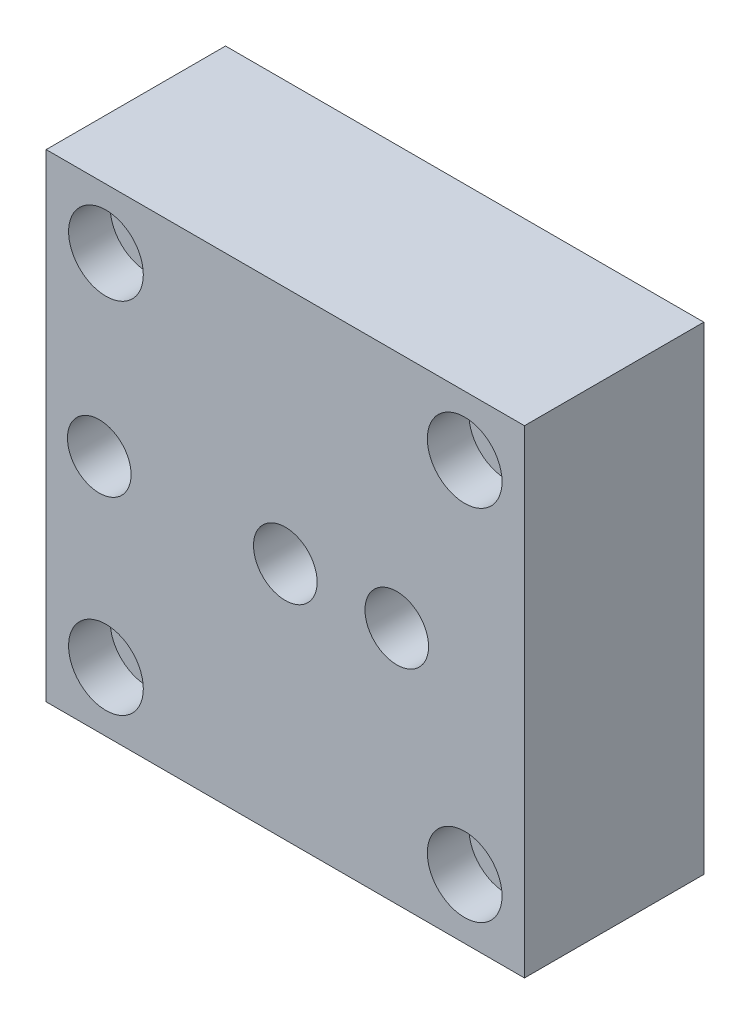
from build123d import *

# Parameters (mm, degrees)
SKETCH1_W                                           = 50.8
SKETCH1_H                                           = 50.8
BOSS_EXTRUDE1_DEPTH                                 = 19.05
CBORE_FOR_8_BINDING_HEAD_MACHINE_SCREW1_D           = 4.3053
CBORE_FOR_8_BINDING_HEAD_MACHINE_SCREW1_CBORE_D     = 7.9375
CBORE_FOR_8_BINDING_HEAD_MACHINE_SCREW1_CBORE_DEPTH = 4.4196
SKETCH5_R                                           = 3.3782
CUT_EXTRUDE1_DEPTH                                  = 41.659838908
SKETCH8_R                                           = 3.3782
CUT_EXTRUDE3_DEPTH                                  = 41.659838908


with BuildPart() as part:
    # Sketch1 → Boss-Extrude1 (new body)
    with BuildSketch(Plane.XY):
        Rectangle(SKETCH1_W, SKETCH1_H)
    extrude(amount=BOSS_EXTRUDE1_DEPTH)

    # CBORE for _8 Binding Head Machine Screw1 (through all)
    with Locations(Plane.XY.offset(19.05)):
        with Locations((-19.05, 19.05), (19.05, 19.05), (-19.05, -19.05), (19.05, -19.05)):
            CounterBoreHole(CBORE_FOR_8_BINDING_HEAD_MACHINE_SCREW1_D / 2, CBORE_FOR_8_BINDING_HEAD_MACHINE_SCREW1_CBORE_D / 2, CBORE_FOR_8_BINDING_HEAD_MACHINE_SCREW1_CBORE_DEPTH)

    # Sketch5 → Cut-Extrude1 (cut, through all)
    with BuildSketch(Plane.XY.offset(19.05)):
        Circle(SKETCH5_R)
    extrude(amount=-CUT_EXTRUDE1_DEPTH, mode=Mode.SUBTRACT)

    # Sketch8 → Cut-Extrude3 (cut, through all)
    with BuildSketch(Plane.XY.offset(19.05)):
        with Locations((-19.7612, 0)):
            Circle(SKETCH8_R)
        with Locations((11.8364, 0)):
            Circle(SKETCH8_R)
    extrude(amount=-CUT_EXTRUDE3_DEPTH, mode=Mode.SUBTRACT)


solid = part.part
